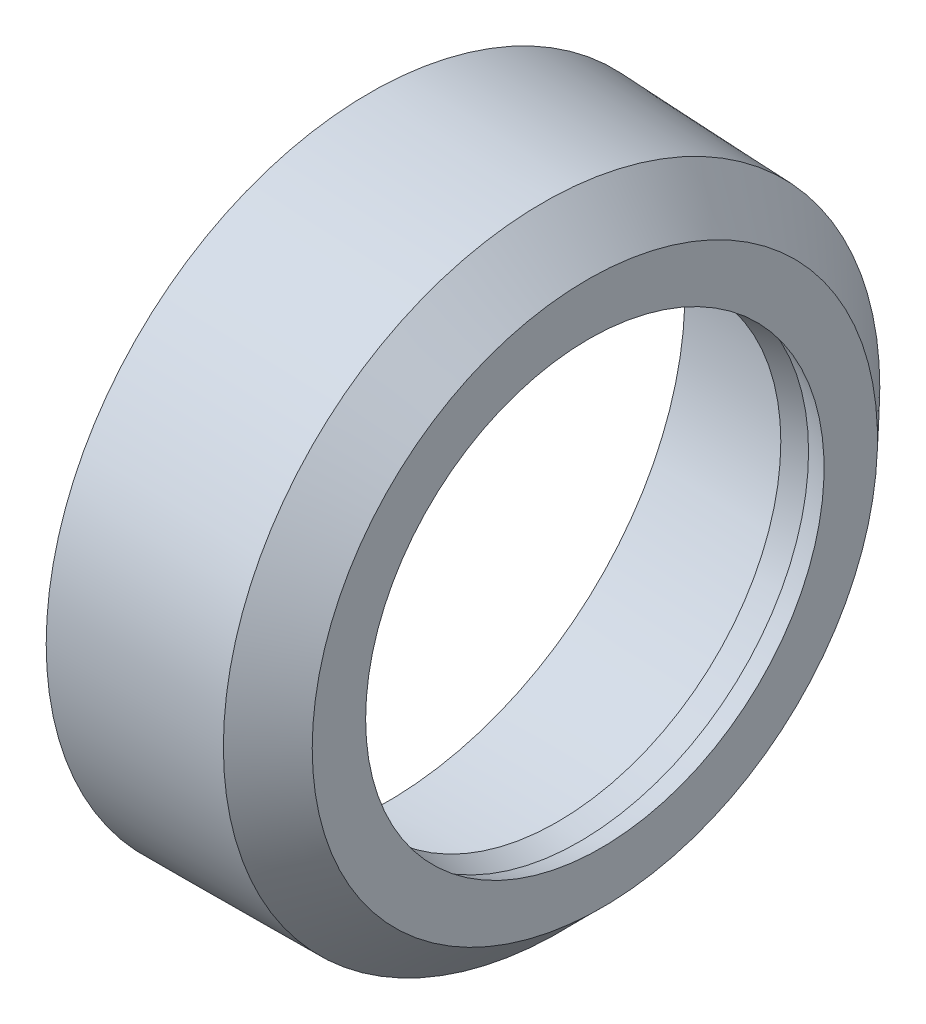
from build123d import *


with BuildPart() as part:
    # Esquisse2 → Base-R_volution (revolve)
    with BuildSketch(Plane(origin=(0.97442316, 0, -37.211719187), x_dir=(0.9996573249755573, 0, 0.026176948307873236), z_dir=(-0.02617694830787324, 0, 0.9996573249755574)), mode=Mode.PRIVATE) as base_r_volution_sk:
        Polygon((63.025242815, -8.231818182), (77.025242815, -8.55), (77.025242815, -14.15), (78.775242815, -13.681088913), (80.525242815, -14.15), (80.525242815, -10.049483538), (77.025242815, -6.549483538), (63.025242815, -6.23130172), align=None)
    revolve(base_r_volution_sk.sketch.rotate(Axis((75.677204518, -31.75, -35.255558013), (-0.9996573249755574, 0, -0.02617694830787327)), 270), axis=Axis((75.677204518, -31.75, -35.255558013), (-0.9996573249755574, 0, -0.02617694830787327)))


solid = part.part
